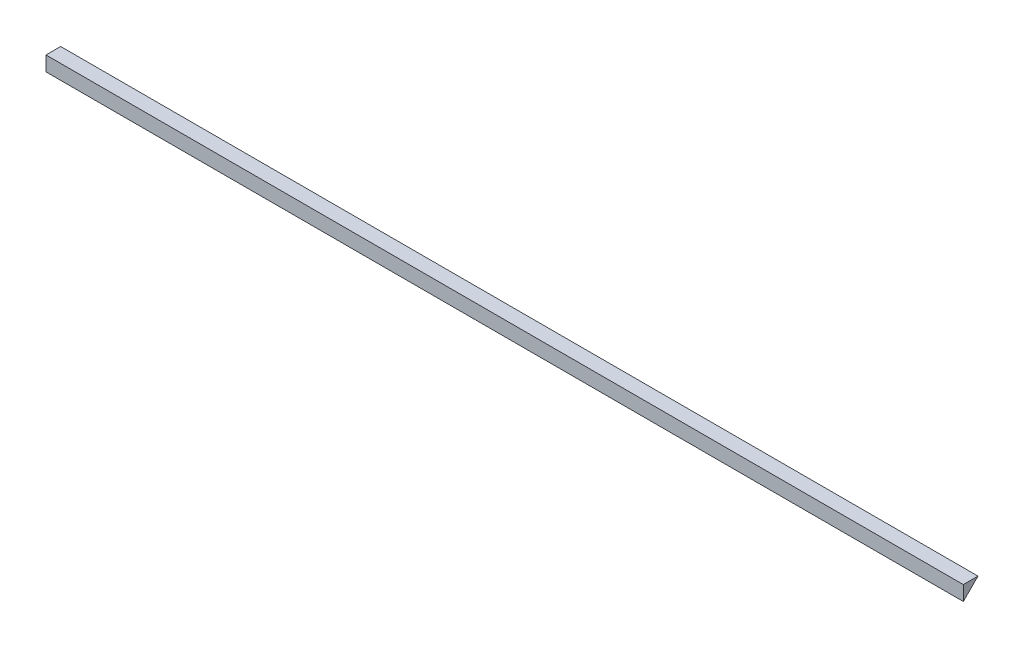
ISO-10303-21;
HEADER;
FILE_DESCRIPTION(('STEP AP214'),'2;1');
FILE_NAME('part.step','',(''),(''),'','','');
FILE_SCHEMA(('AUTOMOTIVE_DESIGN { 1 0 10303 214 1 1 1 1 }'));
ENDSEC;
DATA;
#1=APPLICATION_CONTEXT('core data for automotive mechanical design processes');
#2=APPLICATION_PROTOCOL_DEFINITION('international standard','automotive_design',2000,#1);
#3=PRODUCT_CONTEXT('',#1,'mechanical');
#4=PRODUCT('Part','Part','',(#3));
#5=PRODUCT_RELATED_PRODUCT_CATEGORY('part','',(#4));
#6=PRODUCT_DEFINITION_FORMATION('','',#4);
#7=PRODUCT_DEFINITION_CONTEXT('part definition',#1,'design');
#8=PRODUCT_DEFINITION('design','',#6,#7);
#9=PRODUCT_DEFINITION_SHAPE('','',#8);
#10=(LENGTH_UNIT() NAMED_UNIT(*) SI_UNIT(.MILLI.,.METRE.));
#11=(NAMED_UNIT(*) PLANE_ANGLE_UNIT() SI_UNIT($,.RADIAN.));
#12=(NAMED_UNIT(*) SI_UNIT($,.STERADIAN.) SOLID_ANGLE_UNIT());
#13=UNCERTAINTY_MEASURE_WITH_UNIT(LENGTH_MEASURE(1.E-05),#10,'distance_accuracy_value','');
#14=(GEOMETRIC_REPRESENTATION_CONTEXT(3) GLOBAL_UNCERTAINTY_ASSIGNED_CONTEXT((#13)) GLOBAL_UNIT_ASSIGNED_CONTEXT((#10,
#11,#12)) REPRESENTATION_CONTEXT('',''));
#15=CARTESIAN_POINT('',(0.,0.,0.));
#16=DIRECTION('',(0.,0.,1.));
#17=DIRECTION('',(1.,0.,0.));
#18=AXIS2_PLACEMENT_3D('',#15,#16,#17);
#19=CARTESIAN_POINT('',(20.,0.,0.));
#20=DIRECTION('',(1.,0.,0.));
#21=DIRECTION('',(0.,0.,-1.));
#22=AXIS2_PLACEMENT_3D('',#19,#20,#21);
#23=PLANE('',#22);
#24=DIRECTION('',(0.,1.,0.));
#25=VECTOR('',#24,1.);
#26=CARTESIAN_POINT('',(20.,15.,29.));
#27=LINE('',#26,#25);
#28=CARTESIAN_POINT('',(20.,14.8,29.));
#29=VERTEX_POINT('',#28);
#30=CARTESIAN_POINT('',(20.,15.,29.));
#31=VERTEX_POINT('',#30);
#32=EDGE_CURVE('E20',#29,#31,#27,.T.);
#33=ORIENTED_EDGE('',*,*,#32,.F.);
#34=DIRECTION('',(0.,0.707106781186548,-0.707106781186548));
#35=VECTOR('',#34,1.);
#36=CARTESIAN_POINT('',(20.,14.8,29.));
#37=LINE('',#36,#35);
#38=CARTESIAN_POINT('',(20.,15.,28.8));
#39=VERTEX_POINT('',#38);
#40=EDGE_CURVE('E55',#39,#29,#37,.F.);
#41=ORIENTED_EDGE('',*,*,#40,.F.);
#42=DIRECTION('',(0.,0.,1.));
#43=VECTOR('',#42,1.);
#44=CARTESIAN_POINT('',(20.,15.,28.8));
#45=LINE('',#44,#43);
#46=EDGE_CURVE('E51',#31,#39,#45,.F.);
#47=ORIENTED_EDGE('',*,*,#46,.F.);
#48=EDGE_LOOP('',(#33,#41,#47));
#49=FACE_BOUND('',#48,.T.);
#50=ADVANCED_FACE('F17',(#49),#23,.T.);
#51=CARTESIAN_POINT('',(7.5,15.,29.));
#52=DIRECTION('',(0.,0.,1.));
#53=DIRECTION('',(1.,0.,0.));
#54=AXIS2_PLACEMENT_3D('',#51,#52,#53);
#55=PLANE('',#54);
#56=DIRECTION('',(0.,1.,0.));
#57=VECTOR('',#56,1.);
#58=CARTESIAN_POINT('',(7.5,0.,29.));
#59=LINE('',#58,#57);
#60=CARTESIAN_POINT('',(7.5,15.,29.));
#61=VERTEX_POINT('',#60);
#62=CARTESIAN_POINT('',(7.5,14.8,29.));
#63=VERTEX_POINT('',#62);
#64=EDGE_CURVE('E46',#61,#63,#59,.F.);
#65=ORIENTED_EDGE('',*,*,#64,.T.);
#66=DIRECTION('',(1.,0.,0.));
#67=VECTOR('',#66,1.);
#68=CARTESIAN_POINT('',(7.5,14.8,29.));
#69=LINE('',#68,#67);
#70=EDGE_CURVE('E63',#29,#63,#69,.F.);
#71=ORIENTED_EDGE('',*,*,#70,.F.);
#72=ORIENTED_EDGE('',*,*,#32,.T.);
#73=DIRECTION('',(1.,0.,0.));
#74=VECTOR('',#73,1.);
#75=CARTESIAN_POINT('',(7.5,15.,29.));
#76=LINE('',#75,#74);
#77=EDGE_CURVE('E61',#61,#31,#76,.T.);
#78=ORIENTED_EDGE('',*,*,#77,.F.);
#79=EDGE_LOOP('',(#65,#71,#72,#78));
#80=FACE_BOUND('',#79,.T.);
#81=ADVANCED_FACE('F60',(#80),#55,.T.);
#82=CARTESIAN_POINT('',(7.5,0.,0.));
#83=DIRECTION('',(1.,0.,0.));
#84=DIRECTION('',(0.,0.,-1.));
#85=AXIS2_PLACEMENT_3D('',#82,#83,#84);
#86=PLANE('',#85);
#87=DIRECTION('',(0.,0.707106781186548,-0.707106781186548));
#88=VECTOR('',#87,1.);
#89=CARTESIAN_POINT('',(7.5,14.8,29.));
#90=LINE('',#89,#88);
#91=CARTESIAN_POINT('',(7.5,15.,28.8));
#92=VERTEX_POINT('',#91);
#93=EDGE_CURVE('E26',#63,#92,#90,.T.);
#94=ORIENTED_EDGE('',*,*,#93,.F.);
#95=ORIENTED_EDGE('',*,*,#64,.F.);
#96=DIRECTION('',(0.,0.,1.));
#97=VECTOR('',#96,1.);
#98=CARTESIAN_POINT('',(7.5,15.,28.8));
#99=LINE('',#98,#97);
#100=EDGE_CURVE('E35',#92,#61,#99,.T.);
#101=ORIENTED_EDGE('',*,*,#100,.F.);
#102=EDGE_LOOP('',(#94,#95,#101));
#103=FACE_BOUND('',#102,.T.);
#104=ADVANCED_FACE('F70',(#103),#86,.F.);
#105=CARTESIAN_POINT('',(7.5,15.,28.8));
#106=DIRECTION('',(0.,1.,0.));
#107=DIRECTION('',(0.,0.,1.));
#108=AXIS2_PLACEMENT_3D('',#105,#106,#107);
#109=PLANE('',#108);
#110=ORIENTED_EDGE('',*,*,#100,.T.);
#111=ORIENTED_EDGE('',*,*,#77,.T.);
#112=ORIENTED_EDGE('',*,*,#46,.T.);
#113=DIRECTION('',(1.,0.,0.));
#114=VECTOR('',#113,1.);
#115=CARTESIAN_POINT('',(7.5,15.,28.8));
#116=LINE('',#115,#114);
#117=EDGE_CURVE('E11',#92,#39,#116,.T.);
#118=ORIENTED_EDGE('',*,*,#117,.F.);
#119=EDGE_LOOP('',(#110,#111,#112,#118));
#120=FACE_BOUND('',#119,.T.);
#121=ADVANCED_FACE('F64',(#120),#109,.T.);
#122=CARTESIAN_POINT('',(7.5,14.8,29.));
#123=DIRECTION('',(0.,-0.707106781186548,-0.707106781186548));
#124=DIRECTION('',(0.,0.707106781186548,-0.707106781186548));
#125=AXIS2_PLACEMENT_3D('',#122,#123,#124);
#126=PLANE('',#125);
#127=ORIENTED_EDGE('',*,*,#93,.T.);
#128=ORIENTED_EDGE('',*,*,#117,.T.);
#129=ORIENTED_EDGE('',*,*,#40,.T.);
#130=ORIENTED_EDGE('',*,*,#70,.T.);
#131=EDGE_LOOP('',(#127,#128,#129,#130));
#132=FACE_BOUND('',#131,.T.);
#133=ADVANCED_FACE('F73',(#132),#126,.T.);
#134=CLOSED_SHELL('',(#50,#81,#104,#121,#133));
#135=MANIFOLD_SOLID_BREP('B1',#134);
#136=ADVANCED_BREP_SHAPE_REPRESENTATION('',(#18,#135),#14);
#137=SHAPE_DEFINITION_REPRESENTATION(#9,#136);
ENDSEC;
END-ISO-10303-21;
